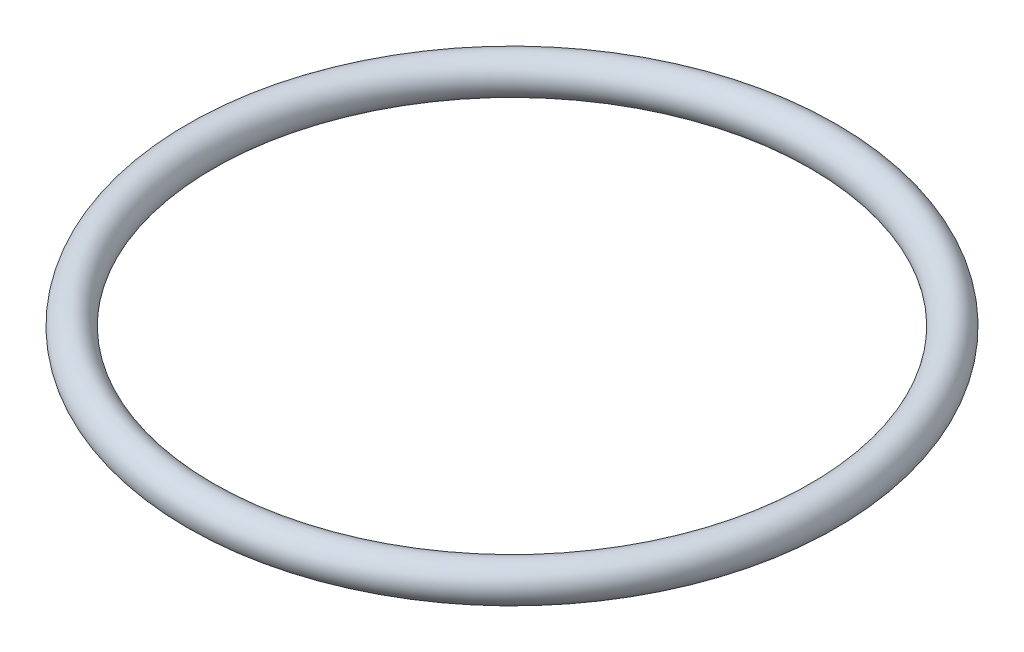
ISO-10303-21;
HEADER;
FILE_DESCRIPTION(('STEP AP214'),'2;1');
FILE_NAME('part.step','',(''),(''),'','','');
FILE_SCHEMA(('AUTOMOTIVE_DESIGN { 1 0 10303 214 1 1 1 1 }'));
ENDSEC;
DATA;
#1=APPLICATION_CONTEXT('core data for automotive mechanical design processes');
#2=APPLICATION_PROTOCOL_DEFINITION('international standard','automotive_design',2000,#1);
#3=PRODUCT_CONTEXT('',#1,'mechanical');
#4=PRODUCT('Part','Part','',(#3));
#5=PRODUCT_RELATED_PRODUCT_CATEGORY('part','',(#4));
#6=PRODUCT_DEFINITION_FORMATION('','',#4);
#7=PRODUCT_DEFINITION_CONTEXT('part definition',#1,'design');
#8=PRODUCT_DEFINITION('design','',#6,#7);
#9=PRODUCT_DEFINITION_SHAPE('','',#8);
#10=(LENGTH_UNIT() NAMED_UNIT(*) SI_UNIT(.MILLI.,.METRE.));
#11=(NAMED_UNIT(*) PLANE_ANGLE_UNIT() SI_UNIT($,.RADIAN.));
#12=(NAMED_UNIT(*) SI_UNIT($,.STERADIAN.) SOLID_ANGLE_UNIT());
#13=UNCERTAINTY_MEASURE_WITH_UNIT(LENGTH_MEASURE(1.E-05),#10,'distance_accuracy_value','');
#14=(GEOMETRIC_REPRESENTATION_CONTEXT(3) GLOBAL_UNCERTAINTY_ASSIGNED_CONTEXT((#13)) GLOBAL_UNIT_ASSIGNED_CONTEXT((#10,
#11,#12)) REPRESENTATION_CONTEXT('',''));
#15=CARTESIAN_POINT('',(0.,0.,0.));
#16=DIRECTION('',(0.,0.,1.));
#17=DIRECTION('',(1.,0.,0.));
#18=AXIS2_PLACEMENT_3D('',#15,#16,#17);
#19=CARTESIAN_POINT('',(0.,0.,0.));
#20=DIRECTION('',(0.,-1.,0.));
#21=DIRECTION('',(0.,0.,-1.));
#22=AXIS2_PLACEMENT_3D('',#19,#20,#21);
#23=TOROIDAL_SURFACE('',#22,15.,0.875000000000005);
#24=CARTESIAN_POINT('',(0.,0.,-15.875));
#25=VERTEX_POINT('',#24);
#26=VERTEX_LOOP('',#25);
#27=FACE_BOUND('',#26,.T.);
#28=ADVANCED_FACE('F27',(#27),#23,.T.);
#29=CLOSED_SHELL('',(#28));
#30=MANIFOLD_SOLID_BREP('B2',#29);
#31=ADVANCED_BREP_SHAPE_REPRESENTATION('',(#18,#30),#14);
#32=SHAPE_DEFINITION_REPRESENTATION(#9,#31);
ENDSEC;
END-ISO-10303-21;
